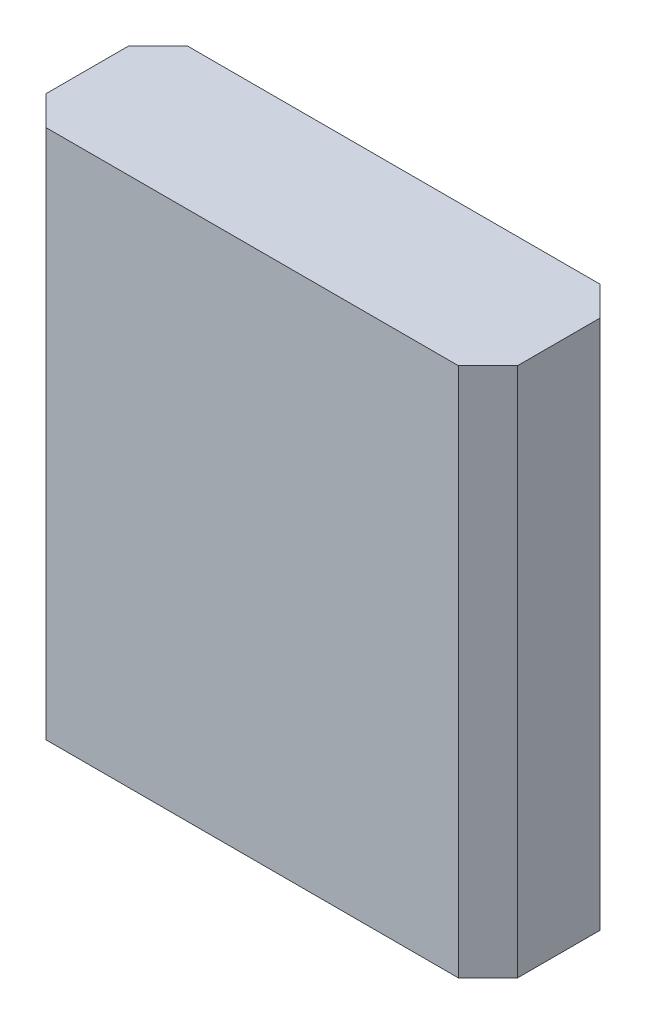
ISO-10303-21;
HEADER;
FILE_DESCRIPTION(('STEP AP214'),'2;1');
FILE_NAME('part.step','',(''),(''),'','','');
FILE_SCHEMA(('AUTOMOTIVE_DESIGN { 1 0 10303 214 1 1 1 1 }'));
ENDSEC;
DATA;
#1=APPLICATION_CONTEXT('core data for automotive mechanical design processes');
#2=APPLICATION_PROTOCOL_DEFINITION('international standard','automotive_design',2000,#1);
#3=PRODUCT_CONTEXT('',#1,'mechanical');
#4=PRODUCT('Part','Part','',(#3));
#5=PRODUCT_RELATED_PRODUCT_CATEGORY('part','',(#4));
#6=PRODUCT_DEFINITION_FORMATION('','',#4);
#7=PRODUCT_DEFINITION_CONTEXT('part definition',#1,'design');
#8=PRODUCT_DEFINITION('design','',#6,#7);
#9=PRODUCT_DEFINITION_SHAPE('','',#8);
#10=(LENGTH_UNIT() NAMED_UNIT(*) SI_UNIT(.MILLI.,.METRE.));
#11=(NAMED_UNIT(*) PLANE_ANGLE_UNIT() SI_UNIT($,.RADIAN.));
#12=(NAMED_UNIT(*) SI_UNIT($,.STERADIAN.) SOLID_ANGLE_UNIT());
#13=UNCERTAINTY_MEASURE_WITH_UNIT(LENGTH_MEASURE(1.E-05),#10,'distance_accuracy_value','');
#14=(GEOMETRIC_REPRESENTATION_CONTEXT(3) GLOBAL_UNCERTAINTY_ASSIGNED_CONTEXT((#13)) GLOBAL_UNIT_ASSIGNED_CONTEXT((#10,
#11,#12)) REPRESENTATION_CONTEXT('',''));
#15=CARTESIAN_POINT('',(0.,0.,0.));
#16=DIRECTION('',(0.,0.,1.));
#17=DIRECTION('',(1.,0.,0.));
#18=AXIS2_PLACEMENT_3D('',#15,#16,#17);
#19=CARTESIAN_POINT('',(-40.,90.,7.));
#20=DIRECTION('',(1.,0.,0.));
#21=DIRECTION('',(0.,0.,-1.));
#22=AXIS2_PLACEMENT_3D('',#19,#20,#21);
#23=PLANE('',#22);
#24=DIRECTION('',(0.,1.,0.));
#25=VECTOR('',#24,1.);
#26=CARTESIAN_POINT('',(-40.,90.,7.));
#27=LINE('',#26,#25);
#28=CARTESIAN_POINT('',(-40.,0.,7.));
#29=VERTEX_POINT('',#28);
#30=CARTESIAN_POINT('',(-40.,90.,7.));
#31=VERTEX_POINT('',#30);
#32=EDGE_CURVE('E20',#29,#31,#27,.T.);
#33=ORIENTED_EDGE('',*,*,#32,.T.);
#34=DIRECTION('',(0.,0.,1.));
#35=VECTOR('',#34,1.);
#36=CARTESIAN_POINT('',(-40.,90.,0.));
#37=LINE('',#36,#35);
#38=CARTESIAN_POINT('',(-40.,90.,-7.));
#39=VERTEX_POINT('',#38);
#40=EDGE_CURVE('E82',#39,#31,#37,.T.);
#41=ORIENTED_EDGE('',*,*,#40,.F.);
#42=DIRECTION('',(0.,1.,0.));
#43=VECTOR('',#42,1.);
#44=CARTESIAN_POINT('',(-40.,90.,-7.));
#45=LINE('',#44,#43);
#46=CARTESIAN_POINT('',(-40.,0.,-7.));
#47=VERTEX_POINT('',#46);
#48=EDGE_CURVE('E129',#39,#47,#45,.F.);
#49=ORIENTED_EDGE('',*,*,#48,.T.);
#50=DIRECTION('',(0.,0.,1.));
#51=VECTOR('',#50,1.);
#52=CARTESIAN_POINT('',(-40.,0.,0.));
#53=LINE('',#52,#51);
#54=EDGE_CURVE('E92',#47,#29,#53,.T.);
#55=ORIENTED_EDGE('',*,*,#54,.T.);
#56=EDGE_LOOP('',(#33,#41,#49,#55));
#57=FACE_BOUND('',#56,.T.);
#58=ADVANCED_FACE('F17',(#57),#23,.F.);
#59=CARTESIAN_POINT('',(-35.,90.,12.));
#60=DIRECTION('',(0.707106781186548,0.,-0.707106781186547));
#61=DIRECTION('',(-0.707106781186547,0.,-0.707106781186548));
#62=AXIS2_PLACEMENT_3D('',#59,#60,#61);
#63=PLANE('',#62);
#64=DIRECTION('',(0.,1.,0.));
#65=VECTOR('',#64,1.);
#66=CARTESIAN_POINT('',(-35.,90.,12.));
#67=LINE('',#66,#65);
#68=CARTESIAN_POINT('',(-35.,0.,12.));
#69=VERTEX_POINT('',#68);
#70=CARTESIAN_POINT('',(-35.,90.,12.));
#71=VERTEX_POINT('',#70);
#72=EDGE_CURVE('E96',#69,#71,#67,.T.);
#73=ORIENTED_EDGE('',*,*,#72,.T.);
#74=DIRECTION('',(0.707106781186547,0.,0.707106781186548));
#75=VECTOR('',#74,1.);
#76=CARTESIAN_POINT('',(-40.,90.,7.));
#77=LINE('',#76,#75);
#78=EDGE_CURVE('E79',#31,#71,#77,.T.);
#79=ORIENTED_EDGE('',*,*,#78,.F.);
#80=ORIENTED_EDGE('',*,*,#32,.F.);
#81=DIRECTION('',(0.707106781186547,0.,0.707106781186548));
#82=VECTOR('',#81,1.);
#83=CARTESIAN_POINT('',(-40.,0.,7.));
#84=LINE('',#83,#82);
#85=EDGE_CURVE('E133',#29,#69,#84,.T.);
#86=ORIENTED_EDGE('',*,*,#85,.T.);
#87=EDGE_LOOP('',(#73,#79,#80,#86));
#88=FACE_BOUND('',#87,.T.);
#89=ADVANCED_FACE('F97',(#88),#63,.F.);
#90=CARTESIAN_POINT('',(-35.,90.,12.));
#91=DIRECTION('',(0.,0.,-1.));
#92=DIRECTION('',(-1.,0.,0.));
#93=AXIS2_PLACEMENT_3D('',#90,#91,#92);
#94=PLANE('',#93);
#95=DIRECTION('',(0.,1.,0.));
#96=VECTOR('',#95,1.);
#97=CARTESIAN_POINT('',(35.,90.,12.));
#98=LINE('',#97,#96);
#99=CARTESIAN_POINT('',(35.,0.,12.));
#100=VERTEX_POINT('',#99);
#101=CARTESIAN_POINT('',(35.,90.,12.));
#102=VERTEX_POINT('',#101);
#103=EDGE_CURVE('E110',#100,#102,#98,.T.);
#104=ORIENTED_EDGE('',*,*,#103,.T.);
#105=DIRECTION('',(1.,0.,0.));
#106=VECTOR('',#105,1.);
#107=CARTESIAN_POINT('',(0.,90.,12.));
#108=LINE('',#107,#106);
#109=EDGE_CURVE('E99',#71,#102,#108,.T.);
#110=ORIENTED_EDGE('',*,*,#109,.F.);
#111=ORIENTED_EDGE('',*,*,#72,.F.);
#112=DIRECTION('',(1.,0.,0.));
#113=VECTOR('',#112,1.);
#114=CARTESIAN_POINT('',(0.,0.,12.));
#115=LINE('',#114,#113);
#116=EDGE_CURVE('E117',#69,#100,#115,.T.);
#117=ORIENTED_EDGE('',*,*,#116,.T.);
#118=EDGE_LOOP('',(#104,#110,#111,#117));
#119=FACE_BOUND('',#118,.T.);
#120=ADVANCED_FACE('F115',(#119),#94,.F.);
#121=CARTESIAN_POINT('',(35.,90.,12.));
#122=DIRECTION('',(-0.707106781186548,0.,-0.707106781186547));
#123=DIRECTION('',(-0.707106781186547,0.,0.707106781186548));
#124=AXIS2_PLACEMENT_3D('',#121,#122,#123);
#125=PLANE('',#124);
#126=DIRECTION('',(0.,1.,0.));
#127=VECTOR('',#126,1.);
#128=CARTESIAN_POINT('',(40.,90.,7.));
#129=LINE('',#128,#127);
#130=CARTESIAN_POINT('',(40.,0.,7.));
#131=VERTEX_POINT('',#130);
#132=CARTESIAN_POINT('',(40.,90.,7.));
#133=VERTEX_POINT('',#132);
#134=EDGE_CURVE('E107',#131,#133,#129,.T.);
#135=ORIENTED_EDGE('',*,*,#134,.T.);
#136=DIRECTION('',(0.707106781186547,0.,-0.707106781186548));
#137=VECTOR('',#136,1.);
#138=CARTESIAN_POINT('',(35.,90.,12.));
#139=LINE('',#138,#137);
#140=EDGE_CURVE('E101',#102,#133,#139,.T.);
#141=ORIENTED_EDGE('',*,*,#140,.F.);
#142=ORIENTED_EDGE('',*,*,#103,.F.);
#143=DIRECTION('',(0.707106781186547,0.,-0.707106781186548));
#144=VECTOR('',#143,1.);
#145=CARTESIAN_POINT('',(35.,0.,12.));
#146=LINE('',#145,#144);
#147=EDGE_CURVE('E136',#100,#131,#146,.T.);
#148=ORIENTED_EDGE('',*,*,#147,.T.);
#149=EDGE_LOOP('',(#135,#141,#142,#148));
#150=FACE_BOUND('',#149,.T.);
#151=ADVANCED_FACE('F121',(#150),#125,.F.);
#152=CARTESIAN_POINT('',(40.,90.,7.));
#153=DIRECTION('',(-1.,0.,0.));
#154=DIRECTION('',(0.,0.,1.));
#155=AXIS2_PLACEMENT_3D('',#152,#153,#154);
#156=PLANE('',#155);
#157=DIRECTION('',(0.,1.,0.));
#158=VECTOR('',#157,1.);
#159=CARTESIAN_POINT('',(40.,90.,-7.));
#160=LINE('',#159,#158);
#161=CARTESIAN_POINT('',(40.,0.,-6.99999999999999));
#162=VERTEX_POINT('',#161);
#163=CARTESIAN_POINT('',(40.,90.,-6.99999999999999));
#164=VERTEX_POINT('',#163);
#165=EDGE_CURVE('E89',#162,#164,#160,.T.);
#166=ORIENTED_EDGE('',*,*,#165,.T.);
#167=DIRECTION('',(0.,0.,1.));
#168=VECTOR('',#167,1.);
#169=CARTESIAN_POINT('',(40.,90.,0.));
#170=LINE('',#169,#168);
#171=EDGE_CURVE('E123',#133,#164,#170,.F.);
#172=ORIENTED_EDGE('',*,*,#171,.F.);
#173=ORIENTED_EDGE('',*,*,#134,.F.);
#174=DIRECTION('',(0.,0.,1.));
#175=VECTOR('',#174,1.);
#176=CARTESIAN_POINT('',(40.,0.,0.));
#177=LINE('',#176,#175);
#178=EDGE_CURVE('E138',#131,#162,#177,.F.);
#179=ORIENTED_EDGE('',*,*,#178,.T.);
#180=EDGE_LOOP('',(#166,#172,#173,#179));
#181=FACE_BOUND('',#180,.T.);
#182=ADVANCED_FACE('F176',(#181),#156,.F.);
#183=CARTESIAN_POINT('',(40.,90.,-7.));
#184=DIRECTION('',(-0.707106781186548,0.,0.707106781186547));
#185=DIRECTION('',(0.707106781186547,0.,0.707106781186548));
#186=AXIS2_PLACEMENT_3D('',#183,#184,#185);
#187=PLANE('',#186);
#188=DIRECTION('',(0.,1.,0.));
#189=VECTOR('',#188,1.);
#190=CARTESIAN_POINT('',(35.,90.,-12.));
#191=LINE('',#190,#189);
#192=CARTESIAN_POINT('',(35.,0.,-12.));
#193=VERTEX_POINT('',#192);
#194=CARTESIAN_POINT('',(35.,90.,-12.));
#195=VERTEX_POINT('',#194);
#196=EDGE_CURVE('E144',#193,#195,#191,.T.);
#197=ORIENTED_EDGE('',*,*,#196,.T.);
#198=DIRECTION('',(-0.707106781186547,0.,-0.707106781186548));
#199=VECTOR('',#198,1.);
#200=CARTESIAN_POINT('',(40.,90.,-7.));
#201=LINE('',#200,#199);
#202=EDGE_CURVE('E124',#164,#195,#201,.T.);
#203=ORIENTED_EDGE('',*,*,#202,.F.);
#204=ORIENTED_EDGE('',*,*,#165,.F.);
#205=DIRECTION('',(-0.707106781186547,0.,-0.707106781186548));
#206=VECTOR('',#205,1.);
#207=CARTESIAN_POINT('',(40.,0.,-7.));
#208=LINE('',#207,#206);
#209=EDGE_CURVE('E141',#162,#193,#208,.T.);
#210=ORIENTED_EDGE('',*,*,#209,.T.);
#211=EDGE_LOOP('',(#197,#203,#204,#210));
#212=FACE_BOUND('',#211,.T.);
#213=ADVANCED_FACE('F158',(#212),#187,.F.);
#214=CARTESIAN_POINT('',(0.,90.,0.));
#215=DIRECTION('',(0.,1.,0.));
#216=DIRECTION('',(0.,0.,1.));
#217=AXIS2_PLACEMENT_3D('',#214,#215,#216);
#218=PLANE('',#217);
#219=ORIENTED_EDGE('',*,*,#171,.T.);
#220=ORIENTED_EDGE('',*,*,#202,.T.);
#221=DIRECTION('',(1.,0.,0.));
#222=VECTOR('',#221,1.);
#223=CARTESIAN_POINT('',(-35.,90.,-12.));
#224=LINE('',#223,#222);
#225=CARTESIAN_POINT('',(-35.,90.,-12.));
#226=VERTEX_POINT('',#225);
#227=EDGE_CURVE('E147',#195,#226,#224,.F.);
#228=ORIENTED_EDGE('',*,*,#227,.T.);
#229=DIRECTION('',(0.707106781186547,0.,-0.707106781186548));
#230=VECTOR('',#229,1.);
#231=CARTESIAN_POINT('',(-40.,90.,-7.));
#232=LINE('',#231,#230);
#233=EDGE_CURVE('E86',#226,#39,#232,.F.);
#234=ORIENTED_EDGE('',*,*,#233,.T.);
#235=ORIENTED_EDGE('',*,*,#40,.T.);
#236=ORIENTED_EDGE('',*,*,#78,.T.);
#237=ORIENTED_EDGE('',*,*,#109,.T.);
#238=ORIENTED_EDGE('',*,*,#140,.T.);
#239=EDGE_LOOP('',(#219,#220,#228,#234,#235,#236,#237,#238));
#240=FACE_BOUND('',#239,.T.);
#241=ADVANCED_FACE('F84',(#240),#218,.T.);
#242=CARTESIAN_POINT('',(-40.,90.,-7.));
#243=DIRECTION('',(0.707106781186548,0.,0.707106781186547));
#244=DIRECTION('',(0.707106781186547,0.,-0.707106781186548));
#245=AXIS2_PLACEMENT_3D('',#242,#243,#244);
#246=PLANE('',#245);
#247=ORIENTED_EDGE('',*,*,#48,.F.);
#248=ORIENTED_EDGE('',*,*,#233,.F.);
#249=DIRECTION('',(0.,1.,0.));
#250=VECTOR('',#249,1.);
#251=CARTESIAN_POINT('',(-35.,90.,-12.));
#252=LINE('',#251,#250);
#253=CARTESIAN_POINT('',(-35.,0.,-12.));
#254=VERTEX_POINT('',#253);
#255=EDGE_CURVE('E26',#226,#254,#252,.F.);
#256=ORIENTED_EDGE('',*,*,#255,.T.);
#257=DIRECTION('',(-0.707106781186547,0.,0.707106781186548));
#258=VECTOR('',#257,1.);
#259=CARTESIAN_POINT('',(-35.,0.,-12.));
#260=LINE('',#259,#258);
#261=EDGE_CURVE('E34',#254,#47,#260,.T.);
#262=ORIENTED_EDGE('',*,*,#261,.T.);
#263=EDGE_LOOP('',(#247,#248,#256,#262));
#264=FACE_BOUND('',#263,.T.);
#265=ADVANCED_FACE('F152',(#264),#246,.F.);
#266=CARTESIAN_POINT('',(0.,0.,0.));
#267=DIRECTION('',(0.,1.,0.));
#268=DIRECTION('',(0.,0.,1.));
#269=AXIS2_PLACEMENT_3D('',#266,#267,#268);
#270=PLANE('',#269);
#271=ORIENTED_EDGE('',*,*,#209,.F.);
#272=ORIENTED_EDGE('',*,*,#178,.F.);
#273=ORIENTED_EDGE('',*,*,#147,.F.);
#274=ORIENTED_EDGE('',*,*,#116,.F.);
#275=ORIENTED_EDGE('',*,*,#85,.F.);
#276=ORIENTED_EDGE('',*,*,#54,.F.);
#277=ORIENTED_EDGE('',*,*,#261,.F.);
#278=DIRECTION('',(1.,0.,0.));
#279=VECTOR('',#278,1.);
#280=CARTESIAN_POINT('',(-35.,0.,-12.));
#281=LINE('',#280,#279);
#282=EDGE_CURVE('E11',#254,#193,#281,.T.);
#283=ORIENTED_EDGE('',*,*,#282,.T.);
#284=EDGE_LOOP('',(#271,#272,#273,#274,#275,#276,#277,#283));
#285=FACE_BOUND('',#284,.T.);
#286=ADVANCED_FACE('F161',(#285),#270,.F.);
#287=CARTESIAN_POINT('',(-35.,90.,-12.));
#288=DIRECTION('',(0.,0.,1.));
#289=DIRECTION('',(1.,0.,0.));
#290=AXIS2_PLACEMENT_3D('',#287,#288,#289);
#291=PLANE('',#290);
#292=ORIENTED_EDGE('',*,*,#255,.F.);
#293=ORIENTED_EDGE('',*,*,#227,.F.);
#294=ORIENTED_EDGE('',*,*,#196,.F.);
#295=ORIENTED_EDGE('',*,*,#282,.F.);
#296=EDGE_LOOP('',(#292,#293,#294,#295));
#297=FACE_BOUND('',#296,.T.);
#298=ADVANCED_FACE('F155',(#297),#291,.F.);
#299=CLOSED_SHELL('',(#58,#89,#120,#151,#182,#213,#241,#265,#286,#298));
#300=MANIFOLD_SOLID_BREP('B1',#299);
#301=ADVANCED_BREP_SHAPE_REPRESENTATION('',(#18,#300),#14);
#302=SHAPE_DEFINITION_REPRESENTATION(#9,#301);
ENDSEC;
END-ISO-10303-21;
